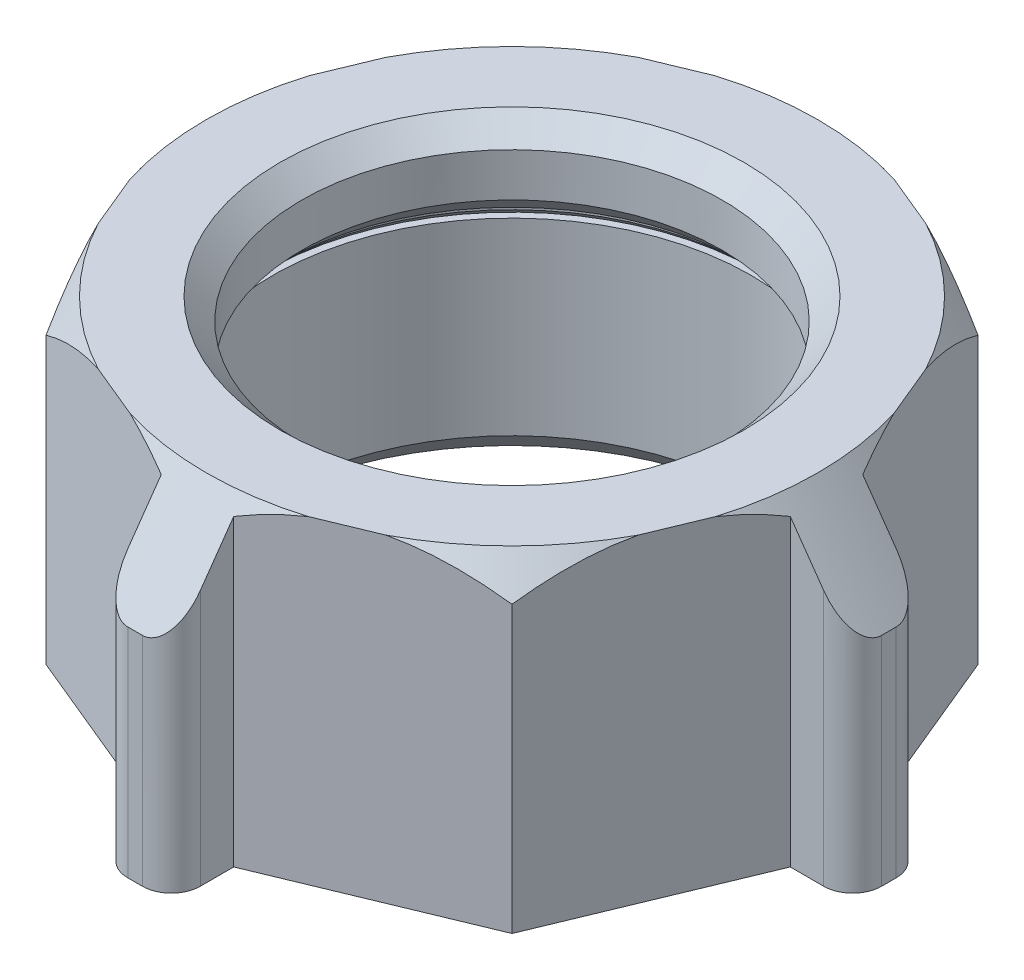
from build123d import *

# Parameters (mm, degrees)
ESTRUSIONE1_DEPTH                    = 22
SCHIZZO2_R                           = 14.5
TAGLIO_ESTRUSIONE1_DEPTH             = 39.952885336
SCHIZZO3_R                           = 16.5
TAGLIO_ESTRUSIONE2_DEPTH             = 16
SCHIZZO4_W                           = 7.269763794
SCHIZZO4_H                           = 22
ESTRUSIONE2_DEPTH                    = 2.5
RACCORDO1_R                          = 2
RIPETIZIONECIRCOLARE1_COUNT          = 4
RACCORDO1_OF_RIPETIZIONECIRCOLARE1_R = 2


with BuildPart() as part:
    # Schizzo1 → Estrusione1 (new body)
    with BuildSketch(Plane(origin=(0, 0, 0), x_dir=(1, 0, 0), z_dir=(0, 1, 0))):
        Polygon((22.730236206, 0), (16.072704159, 16.072704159), (0, 22.730236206), (-16.072704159, 16.072704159), (-22.730236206, 0), (-16.072704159, -16.072704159), (0, -22.730236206), (16.072704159, -16.072704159), align=None)
    extrude(amount=ESTRUSIONE1_DEPTH)

    # Schizzo2 → Taglio-Estrusione1 (cut, through all)
    with BuildSketch(Plane(origin=(0, 22, 0), x_dir=(-1, 0, 0), z_dir=(0, 1, 0))):
        with Locations(Location((0, 0, 0), (0, 0, 90))):
            Circle(SCHIZZO2_R)
    extrude(amount=-TAGLIO_ESTRUSIONE1_DEPTH, mode=Mode.SUBTRACT)

    # Schizzo3 → Taglio-Estrusione2 (cut)
    with BuildSketch(Plane.XZ):
        with Locations(Location((0, 0, 0), (0, 0, 270))):
            Circle(SCHIZZO3_R)
    extrude(amount=-TAGLIO_ESTRUSIONE2_DEPTH, mode=Mode.SUBTRACT)

    # Schizzo4 → Estrusione2 (add, symmetric)
    with BuildSketch(Plane.XY):
        with Locations((22.365118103, 11)):
            Rectangle(SCHIZZO4_W, SCHIZZO4_H)
    estrusione2 = extrude(amount=ESTRUSIONE2_DEPTH, both=True)

    # Raccordo1
    raccordo1_edges = [part.edges().sort_by_distance(p)[0] for p in [
        (26, 11, 2.5),
        (26, 11, -2.5),
    ]]
    fillet(raccordo1_edges, radius=RACCORDO1_R)

    # RipetizioneCircolare1: Estrusione2 ×4 about axis
    ripetizionecircolare1_axis = Axis((0, 0, 0), (0, 1, 0))
    for i in range(1, RIPETIZIONECIRCOLARE1_COUNT):
        add(estrusione2.rotate(ripetizionecircolare1_axis, i * 360 / RIPETIZIONECIRCOLARE1_COUNT))

    # Raccordo1 of RipetizioneCircolare1
    raccordo1_of_ripetizionecircolare1_edges = [part.edges().sort_by_distance(p)[0] for p in [
        (2.5, 11, -26),
        (-2.5, 11, -26),
        (-26, 11, -2.5),
        (-26, 11, 2.5),
        (-2.5, 11, 26),
        (2.5, 11, 26),
    ]]
    fillet(raccordo1_of_ripetizionecircolare1_edges, radius=RACCORDO1_OF_RIPETIZIONECIRCOLARE1_R)

    # Schizzo5 → Taglia-Rivoluzione1 (revolve, cut)
    with BuildSketch(Plane.XY, mode=Mode.PRIVATE) as taglia_rivoluzione1_sk:
        Polygon((17.597509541, 27), (31, 7.859259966), (31, 27), align=None)
        Polygon((13.5, 23), (17, 23), (13.5, 19.5), align=None)
        Polygon((17, 15), (13.5, 18.5), (13.5, 15), align=None)
        Polygon((19.5, -1), (15, 3.5), (15, -1), align=None)
    revolve(taglia_rivoluzione1_sk.sketch.rotate(Axis((0, 0, 0), (0, 1, 0)), 90), axis=Axis((0, 0, 0), (0, 1, 0)), mode=Mode.SUBTRACT)


solid = part.part
